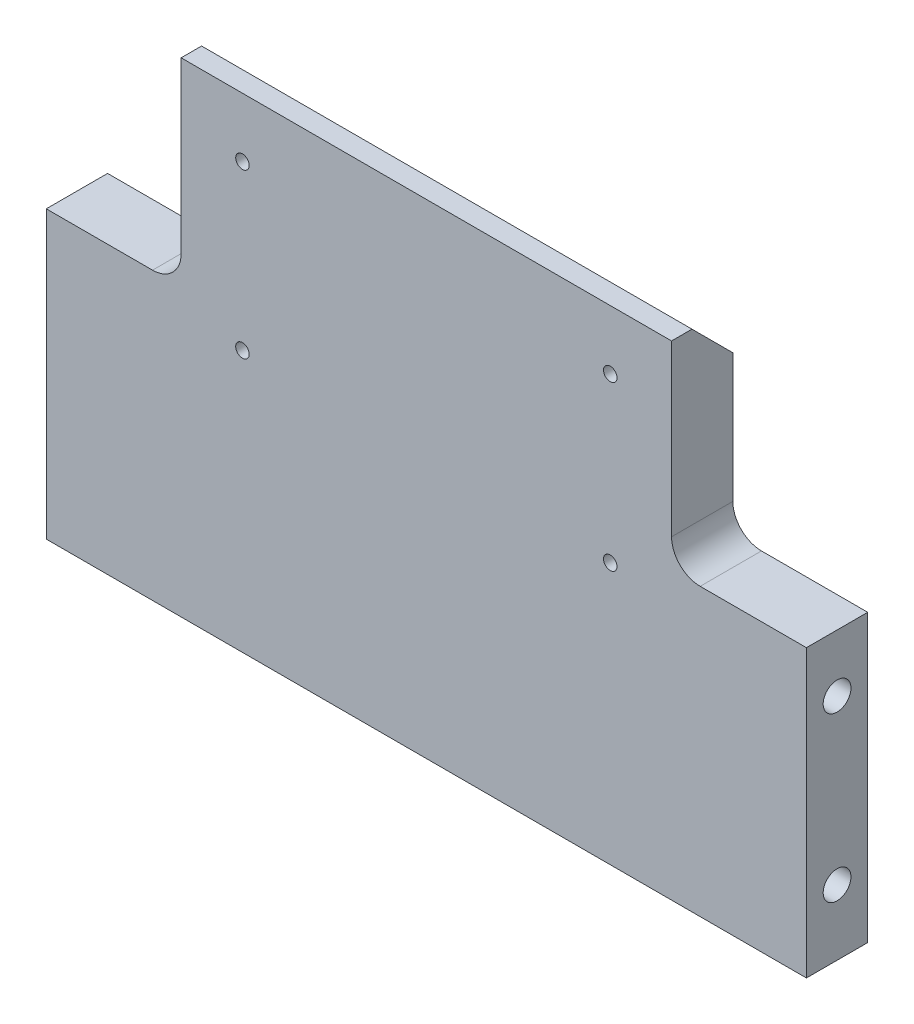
ISO-10303-21;
HEADER;
FILE_DESCRIPTION(('STEP AP214'),'2;1');
FILE_NAME('part.step','',(''),(''),'','','');
FILE_SCHEMA(('AUTOMOTIVE_DESIGN { 1 0 10303 214 1 1 1 1 }'));
ENDSEC;
DATA;
#1=APPLICATION_CONTEXT('core data for automotive mechanical design processes');
#2=APPLICATION_PROTOCOL_DEFINITION('international standard','automotive_design',2000,#1);
#3=PRODUCT_CONTEXT('',#1,'mechanical');
#4=PRODUCT('Part','Part','',(#3));
#5=PRODUCT_RELATED_PRODUCT_CATEGORY('part','',(#4));
#6=PRODUCT_DEFINITION_FORMATION('','',#4);
#7=PRODUCT_DEFINITION_CONTEXT('part definition',#1,'design');
#8=PRODUCT_DEFINITION('design','',#6,#7);
#9=PRODUCT_DEFINITION_SHAPE('','',#8);
#10=(LENGTH_UNIT() NAMED_UNIT(*) SI_UNIT(.MILLI.,.METRE.));
#11=(NAMED_UNIT(*) PLANE_ANGLE_UNIT() SI_UNIT($,.RADIAN.));
#12=(NAMED_UNIT(*) SI_UNIT($,.STERADIAN.) SOLID_ANGLE_UNIT());
#13=UNCERTAINTY_MEASURE_WITH_UNIT(LENGTH_MEASURE(1.E-05),#10,'distance_accuracy_value','');
#14=(GEOMETRIC_REPRESENTATION_CONTEXT(3) GLOBAL_UNCERTAINTY_ASSIGNED_CONTEXT((#13)) GLOBAL_UNIT_ASSIGNED_CONTEXT((#10,
#11,#12)) REPRESENTATION_CONTEXT('',''));
#15=CARTESIAN_POINT('',(0.,0.,0.));
#16=DIRECTION('',(0.,0.,1.));
#17=DIRECTION('',(1.,0.,0.));
#18=AXIS2_PLACEMENT_3D('',#15,#16,#17);
#19=CARTESIAN_POINT('',(-84.3265927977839,52.551108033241,15.));
#20=DIRECTION('',(1.,0.,0.));
#21=DIRECTION('',(0.,1.,0.));
#22=AXIS2_PLACEMENT_3D('',#19,#20,#21);
#23=PLANE('',#22);
#24=CARTESIAN_POINT('',(-84.3265927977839,-61.448891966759,7.5));
#25=DIRECTION('',(-1.,0.,0.));
#26=DIRECTION('',(0.,0.,1.));
#27=AXIS2_PLACEMENT_3D('',#24,#25,#26);
#28=CIRCLE('',#27,3.39999999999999);
#29=CARTESIAN_POINT('',(-84.3265927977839,-61.448891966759,10.9));
#30=VERTEX_POINT('',#29);
#31=EDGE_CURVE('E260',#30,#30,#28,.T.);
#32=ORIENTED_EDGE('',*,*,#31,.F.);
#33=EDGE_LOOP('',(#32));
#34=FACE_BOUND('',#33,.T.);
#35=CARTESIAN_POINT('',(-84.3265927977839,-21.4488919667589,7.5));
#36=DIRECTION('',(-1.,0.,0.));
#37=DIRECTION('',(0.,0.,1.));
#38=AXIS2_PLACEMENT_3D('',#35,#36,#37);
#39=CIRCLE('',#38,3.39999999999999);
#40=CARTESIAN_POINT('',(-84.3265927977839,-21.4488919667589,10.9));
#41=VERTEX_POINT('',#40);
#42=EDGE_CURVE('E264',#41,#41,#39,.T.);
#43=ORIENTED_EDGE('',*,*,#42,.F.);
#44=EDGE_LOOP('',(#43));
#45=FACE_BOUND('',#44,.T.);
#46=DIRECTION('',(0.,-1.,0.));
#47=VECTOR('',#46,1.);
#48=CARTESIAN_POINT('',(-84.3265927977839,52.551108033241,15.));
#49=LINE('',#48,#47);
#50=CARTESIAN_POINT('',(-84.3265927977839,-7.44889196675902,15.));
#51=VERTEX_POINT('',#50);
#52=CARTESIAN_POINT('',(-84.3265927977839,-77.448891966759,15.));
#53=VERTEX_POINT('',#52);
#54=EDGE_CURVE('E167',#51,#53,#49,.T.);
#55=ORIENTED_EDGE('',*,*,#54,.F.);
#56=DIRECTION('',(0.,0.,1.));
#57=VECTOR('',#56,1.);
#58=CARTESIAN_POINT('',(-84.3265927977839,-7.44889196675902,0.));
#59=LINE('',#58,#57);
#60=CARTESIAN_POINT('',(-84.3265927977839,-7.44889196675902,0.));
#61=VERTEX_POINT('',#60);
#62=EDGE_CURVE('E158',#61,#51,#59,.T.);
#63=ORIENTED_EDGE('',*,*,#62,.F.);
#64=DIRECTION('',(0.,-1.,0.));
#65=VECTOR('',#64,1.);
#66=CARTESIAN_POINT('',(-84.3265927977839,52.551108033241,0.));
#67=LINE('',#66,#65);
#68=CARTESIAN_POINT('',(-84.3265927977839,-77.448891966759,0.));
#69=VERTEX_POINT('',#68);
#70=EDGE_CURVE('E160',#61,#69,#67,.T.);
#71=ORIENTED_EDGE('',*,*,#70,.T.);
#72=DIRECTION('',(0.,0.,-1.));
#73=VECTOR('',#72,1.);
#74=CARTESIAN_POINT('',(-84.3265927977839,-77.448891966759,15.));
#75=LINE('',#74,#73);
#76=EDGE_CURVE('E177',#53,#69,#75,.T.);
#77=ORIENTED_EDGE('',*,*,#76,.F.);
#78=EDGE_LOOP('',(#55,#63,#71,#77));
#79=FACE_BOUND('',#78,.T.);
#80=ADVANCED_FACE('F32',(#34,#45,#79),#23,.F.);
#81=CARTESIAN_POINT('',(-84.3265927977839,-77.448891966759,15.));
#82=DIRECTION('',(0.,1.,0.));
#83=DIRECTION('',(0.,0.,1.));
#84=AXIS2_PLACEMENT_3D('',#81,#82,#83);
#85=PLANE('',#84);
#86=DIRECTION('',(1.,0.,0.));
#87=VECTOR('',#86,1.);
#88=CARTESIAN_POINT('',(-84.3265927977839,-77.448891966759,0.));
#89=LINE('',#88,#87);
#90=CARTESIAN_POINT('',(101.673407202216,-77.448891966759,0.));
#91=VERTEX_POINT('',#90);
#92=EDGE_CURVE('E162',#69,#91,#89,.T.);
#93=ORIENTED_EDGE('',*,*,#92,.T.);
#94=DIRECTION('',(0.,0.,-1.));
#95=VECTOR('',#94,1.);
#96=CARTESIAN_POINT('',(101.673407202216,-77.448891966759,15.));
#97=LINE('',#96,#95);
#98=CARTESIAN_POINT('',(101.673407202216,-77.448891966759,15.));
#99=VERTEX_POINT('',#98);
#100=EDGE_CURVE('E174',#99,#91,#97,.T.);
#101=ORIENTED_EDGE('',*,*,#100,.F.);
#102=DIRECTION('',(1.,0.,0.));
#103=VECTOR('',#102,1.);
#104=CARTESIAN_POINT('',(-84.3265927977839,-77.448891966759,15.));
#105=LINE('',#104,#103);
#106=EDGE_CURVE('E169',#53,#99,#105,.T.);
#107=ORIENTED_EDGE('',*,*,#106,.F.);
#108=ORIENTED_EDGE('',*,*,#76,.T.);
#109=EDGE_LOOP('',(#93,#101,#107,#108));
#110=FACE_BOUND('',#109,.T.);
#111=ADVANCED_FACE('F231',(#110),#85,.F.);
#112=CARTESIAN_POINT('',(101.673407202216,52.551108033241,15.));
#113=DIRECTION('',(-1.,0.,0.));
#114=DIRECTION('',(0.,0.,1.));
#115=AXIS2_PLACEMENT_3D('',#112,#113,#114);
#116=PLANE('',#115);
#117=CARTESIAN_POINT('',(101.673407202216,-61.448891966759,7.5));
#118=DIRECTION('',(1.,0.,0.));
#119=DIRECTION('',(0.,0.,-1.));
#120=AXIS2_PLACEMENT_3D('',#117,#118,#119);
#121=CIRCLE('',#120,3.39999999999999);
#122=CARTESIAN_POINT('',(101.673407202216,-61.448891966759,4.10000000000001));
#123=VERTEX_POINT('',#122);
#124=EDGE_CURVE('E291',#123,#123,#121,.T.);
#125=ORIENTED_EDGE('',*,*,#124,.F.);
#126=EDGE_LOOP('',(#125));
#127=FACE_BOUND('',#126,.T.);
#128=CARTESIAN_POINT('',(101.673407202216,-21.448891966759,7.5));
#129=DIRECTION('',(1.,0.,0.));
#130=DIRECTION('',(0.,0.,-1.));
#131=AXIS2_PLACEMENT_3D('',#128,#129,#130);
#132=CIRCLE('',#131,3.39999999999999);
#133=CARTESIAN_POINT('',(101.673407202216,-21.448891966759,4.10000000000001));
#134=VERTEX_POINT('',#133);
#135=EDGE_CURVE('E294',#134,#134,#132,.T.);
#136=ORIENTED_EDGE('',*,*,#135,.F.);
#137=EDGE_LOOP('',(#136));
#138=FACE_BOUND('',#137,.T.);
#139=DIRECTION('',(0.,1.,0.));
#140=VECTOR('',#139,1.);
#141=CARTESIAN_POINT('',(101.673407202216,52.551108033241,0.));
#142=LINE('',#141,#140);
#143=CARTESIAN_POINT('',(101.673407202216,-7.44889196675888,0.));
#144=VERTEX_POINT('',#143);
#145=EDGE_CURVE('E164',#91,#144,#142,.T.);
#146=ORIENTED_EDGE('',*,*,#145,.T.);
#147=DIRECTION('',(0.,0.,1.));
#148=VECTOR('',#147,1.);
#149=CARTESIAN_POINT('',(101.673407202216,-7.44889196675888,0.));
#150=LINE('',#149,#148);
#151=CARTESIAN_POINT('',(101.673407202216,-7.44889196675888,15.));
#152=VERTEX_POINT('',#151);
#153=EDGE_CURVE('E152',#144,#152,#150,.T.);
#154=ORIENTED_EDGE('',*,*,#153,.T.);
#155=DIRECTION('',(0.,1.,0.));
#156=VECTOR('',#155,1.);
#157=CARTESIAN_POINT('',(101.673407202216,52.551108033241,15.));
#158=LINE('',#157,#156);
#159=EDGE_CURVE('E171',#99,#152,#158,.T.);
#160=ORIENTED_EDGE('',*,*,#159,.F.);
#161=ORIENTED_EDGE('',*,*,#100,.T.);
#162=EDGE_LOOP('',(#146,#154,#160,#161));
#163=FACE_BOUND('',#162,.T.);
#164=ADVANCED_FACE('F220',(#127,#138,#163),#116,.F.);
#165=CARTESIAN_POINT('',(-84.3265927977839,52.551108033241,15.));
#166=DIRECTION('',(0.,0.,1.));
#167=DIRECTION('',(1.,0.,0.));
#168=AXIS2_PLACEMENT_3D('',#165,#166,#167);
#169=PLANE('',#168);
#170=DIRECTION('',(1.,0.,0.));
#171=VECTOR('',#170,1.);
#172=CARTESIAN_POINT('',(-51.326592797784,41.051108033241,15.));
#173=LINE('',#172,#171);
#174=CARTESIAN_POINT('',(-51.326592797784,41.051108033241,15.));
#175=VERTEX_POINT('',#174);
#176=CARTESIAN_POINT('',(68.673407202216,41.051108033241,15.));
#177=VERTEX_POINT('',#176);
#178=EDGE_CURVE('E125',#175,#177,#173,.T.);
#179=ORIENTED_EDGE('',*,*,#178,.F.);
#180=DIRECTION('',(0.,1.,0.));
#181=VECTOR('',#180,1.);
#182=CARTESIAN_POINT('',(-51.326592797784,52.551108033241,15.));
#183=LINE('',#182,#181);
#184=CARTESIAN_POINT('',(-51.326592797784,-0.448891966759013,15.));
#185=VERTEX_POINT('',#184);
#186=EDGE_CURVE('E136',#185,#175,#183,.T.);
#187=ORIENTED_EDGE('',*,*,#186,.F.);
#188=CARTESIAN_POINT('',(-58.326592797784,-0.448891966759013,15.));
#189=DIRECTION('',(0.,0.,1.));
#190=DIRECTION('',(1.,0.,0.));
#191=AXIS2_PLACEMENT_3D('',#188,#189,#190);
#192=CIRCLE('',#191,7.);
#193=CARTESIAN_POINT('',(-58.326592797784,-7.44889196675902,15.));
#194=VERTEX_POINT('',#193);
#195=EDGE_CURVE('E193',#185,#194,#192,.F.);
#196=ORIENTED_EDGE('',*,*,#195,.T.);
#197=DIRECTION('',(1.,0.,0.));
#198=VECTOR('',#197,1.);
#199=CARTESIAN_POINT('',(-84.3265927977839,-7.44889196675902,15.));
#200=LINE('',#199,#198);
#201=EDGE_CURVE('E146',#51,#194,#200,.T.);
#202=ORIENTED_EDGE('',*,*,#201,.F.);
#203=ORIENTED_EDGE('',*,*,#54,.T.);
#204=ORIENTED_EDGE('',*,*,#106,.T.);
#205=ORIENTED_EDGE('',*,*,#159,.T.);
#206=DIRECTION('',(1.,0.,0.));
#207=VECTOR('',#206,1.);
#208=CARTESIAN_POINT('',(68.6734072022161,-7.44889196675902,15.));
#209=LINE('',#208,#207);
#210=CARTESIAN_POINT('',(75.6734072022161,-7.44889196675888,15.));
#211=VERTEX_POINT('',#210);
#212=EDGE_CURVE('E211',#211,#152,#209,.T.);
#213=ORIENTED_EDGE('',*,*,#212,.F.);
#214=CARTESIAN_POINT('',(75.6734072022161,-0.448891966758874,15.));
#215=DIRECTION('',(0.,0.,1.));
#216=DIRECTION('',(1.,0.,0.));
#217=AXIS2_PLACEMENT_3D('',#214,#215,#216);
#218=CIRCLE('',#217,7.);
#219=CARTESIAN_POINT('',(68.6734072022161,-0.448891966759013,15.));
#220=VERTEX_POINT('',#219);
#221=EDGE_CURVE('E189',#211,#220,#218,.F.);
#222=ORIENTED_EDGE('',*,*,#221,.T.);
#223=DIRECTION('',(0.,-1.,0.));
#224=VECTOR('',#223,1.);
#225=CARTESIAN_POINT('',(68.673407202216,52.551108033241,15.));
#226=LINE('',#225,#224);
#227=EDGE_CURVE('E138',#177,#220,#226,.T.);
#228=ORIENTED_EDGE('',*,*,#227,.F.);
#229=EDGE_LOOP('',(#179,#187,#196,#202,#203,#204,#205,#213,#222,#228));
#230=FACE_BOUND('',#229,.T.);
#231=CARTESIAN_POINT('',(-36.326592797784,26.551108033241,15.));
#232=DIRECTION('',(0.,0.,1.));
#233=DIRECTION('',(1.,0.,0.));
#234=AXIS2_PLACEMENT_3D('',#231,#232,#233);
#235=CIRCLE('',#234,1.64999999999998);
#236=CARTESIAN_POINT('',(-34.676592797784,26.551108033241,15.));
#237=VERTEX_POINT('',#236);
#238=EDGE_CURVE('E427',#237,#237,#235,.T.);
#239=ORIENTED_EDGE('',*,*,#238,.F.);
#240=EDGE_LOOP('',(#239));
#241=FACE_BOUND('',#240,.T.);
#242=CARTESIAN_POINT('',(53.673407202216,26.551108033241,15.));
#243=DIRECTION('',(0.,0.,1.));
#244=DIRECTION('',(1.,0.,0.));
#245=AXIS2_PLACEMENT_3D('',#242,#243,#244);
#246=CIRCLE('',#245,1.64999999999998);
#247=CARTESIAN_POINT('',(55.323407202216,26.551108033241,15.));
#248=VERTEX_POINT('',#247);
#249=EDGE_CURVE('E421',#248,#248,#246,.T.);
#250=ORIENTED_EDGE('',*,*,#249,.F.);
#251=EDGE_LOOP('',(#250));
#252=FACE_BOUND('',#251,.T.);
#253=CARTESIAN_POINT('',(53.673407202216,-13.448891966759,15.));
#254=DIRECTION('',(0.,0.,1.));
#255=DIRECTION('',(1.,0.,0.));
#256=AXIS2_PLACEMENT_3D('',#253,#254,#255);
#257=CIRCLE('',#256,1.64999999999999);
#258=CARTESIAN_POINT('',(55.323407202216,-13.448891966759,15.));
#259=VERTEX_POINT('',#258);
#260=EDGE_CURVE('E345',#259,#259,#257,.T.);
#261=ORIENTED_EDGE('',*,*,#260,.F.);
#262=EDGE_LOOP('',(#261));
#263=FACE_BOUND('',#262,.T.);
#264=CARTESIAN_POINT('',(-36.326592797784,-13.448891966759,15.));
#265=DIRECTION('',(0.,0.,1.));
#266=DIRECTION('',(1.,0.,0.));
#267=AXIS2_PLACEMENT_3D('',#264,#265,#266);
#268=CIRCLE('',#267,1.64999999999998);
#269=CARTESIAN_POINT('',(-34.676592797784,-13.448891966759,15.));
#270=VERTEX_POINT('',#269);
#271=EDGE_CURVE('E339',#270,#270,#268,.T.);
#272=ORIENTED_EDGE('',*,*,#271,.F.);
#273=EDGE_LOOP('',(#272));
#274=FACE_BOUND('',#273,.T.);
#275=ADVANCED_FACE('F134',(#230,#241,#252,#263,#274),#169,.T.);
#276=CARTESIAN_POINT('',(-84.3265927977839,52.551108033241,0.));
#277=DIRECTION('',(0.,0.,1.));
#278=DIRECTION('',(1.,0.,0.));
#279=AXIS2_PLACEMENT_3D('',#276,#277,#278);
#280=PLANE('',#279);
#281=CARTESIAN_POINT('',(-36.326592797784,26.551108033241,0.));
#282=DIRECTION('',(0.,0.,1.));
#283=DIRECTION('',(1.,0.,0.));
#284=AXIS2_PLACEMENT_3D('',#281,#282,#283);
#285=CIRCLE('',#284,1.64999999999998);
#286=CARTESIAN_POINT('',(-34.676592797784,26.551108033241,0.));
#287=VERTEX_POINT('',#286);
#288=EDGE_CURVE('E130',#287,#287,#285,.T.);
#289=ORIENTED_EDGE('',*,*,#288,.T.);
#290=EDGE_LOOP('',(#289));
#291=FACE_BOUND('',#290,.T.);
#292=CARTESIAN_POINT('',(53.673407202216,26.551108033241,0.));
#293=DIRECTION('',(0.,0.,1.));
#294=DIRECTION('',(1.,0.,0.));
#295=AXIS2_PLACEMENT_3D('',#292,#293,#294);
#296=CIRCLE('',#295,1.64999999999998);
#297=CARTESIAN_POINT('',(55.323407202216,26.551108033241,0.));
#298=VERTEX_POINT('',#297);
#299=EDGE_CURVE('E424',#298,#298,#296,.T.);
#300=ORIENTED_EDGE('',*,*,#299,.T.);
#301=EDGE_LOOP('',(#300));
#302=FACE_BOUND('',#301,.T.);
#303=CARTESIAN_POINT('',(53.673407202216,-13.448891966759,0.));
#304=DIRECTION('',(0.,0.,1.));
#305=DIRECTION('',(1.,0.,0.));
#306=AXIS2_PLACEMENT_3D('',#303,#304,#305);
#307=CIRCLE('',#306,1.64999999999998);
#308=CARTESIAN_POINT('',(55.323407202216,-13.448891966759,0.));
#309=VERTEX_POINT('',#308);
#310=EDGE_CURVE('E418',#309,#309,#307,.T.);
#311=ORIENTED_EDGE('',*,*,#310,.T.);
#312=EDGE_LOOP('',(#311));
#313=FACE_BOUND('',#312,.T.);
#314=CARTESIAN_POINT('',(-36.326592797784,-13.448891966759,0.));
#315=DIRECTION('',(0.,0.,1.));
#316=DIRECTION('',(1.,0.,0.));
#317=AXIS2_PLACEMENT_3D('',#314,#315,#316);
#318=CIRCLE('',#317,1.64999999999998);
#319=CARTESIAN_POINT('',(-34.676592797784,-13.448891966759,0.));
#320=VERTEX_POINT('',#319);
#321=EDGE_CURVE('E336',#320,#320,#318,.T.);
#322=ORIENTED_EDGE('',*,*,#321,.T.);
#323=EDGE_LOOP('',(#322));
#324=FACE_BOUND('',#323,.T.);
#325=DIRECTION('',(0.,1.,0.));
#326=VECTOR('',#325,1.);
#327=CARTESIAN_POINT('',(-51.326592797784,52.551108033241,0.));
#328=LINE('',#327,#326);
#329=CARTESIAN_POINT('',(-51.326592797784,-0.448891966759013,0.));
#330=VERTEX_POINT('',#329);
#331=CARTESIAN_POINT('',(-51.326592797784,31.051108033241,0.));
#332=VERTEX_POINT('',#331);
#333=EDGE_CURVE('E149',#330,#332,#328,.T.);
#334=ORIENTED_EDGE('',*,*,#333,.T.);
#335=DIRECTION('',(1.,0.,0.));
#336=VECTOR('',#335,1.);
#337=CARTESIAN_POINT('',(-84.3265927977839,31.051108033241,0.));
#338=LINE('',#337,#336);
#339=CARTESIAN_POINT('',(68.6734072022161,31.051108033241,0.));
#340=VERTEX_POINT('',#339);
#341=EDGE_CURVE('E199',#332,#340,#338,.T.);
#342=ORIENTED_EDGE('',*,*,#341,.T.);
#343=DIRECTION('',(0.,-1.,0.));
#344=VECTOR('',#343,1.);
#345=CARTESIAN_POINT('',(68.673407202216,52.551108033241,0.));
#346=LINE('',#345,#344);
#347=CARTESIAN_POINT('',(68.6734072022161,-0.448891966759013,0.));
#348=VERTEX_POINT('',#347);
#349=EDGE_CURVE('E205',#340,#348,#346,.T.);
#350=ORIENTED_EDGE('',*,*,#349,.T.);
#351=CARTESIAN_POINT('',(75.6734072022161,-0.448891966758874,0.));
#352=DIRECTION('',(0.,0.,1.));
#353=DIRECTION('',(1.,0.,0.));
#354=AXIS2_PLACEMENT_3D('',#351,#352,#353);
#355=CIRCLE('',#354,7.);
#356=CARTESIAN_POINT('',(75.6734072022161,-7.44889196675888,0.));
#357=VERTEX_POINT('',#356);
#358=EDGE_CURVE('E191',#348,#357,#355,.T.);
#359=ORIENTED_EDGE('',*,*,#358,.T.);
#360=DIRECTION('',(1.,0.,0.));
#361=VECTOR('',#360,1.);
#362=CARTESIAN_POINT('',(68.6734072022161,-7.44889196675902,0.));
#363=LINE('',#362,#361);
#364=EDGE_CURVE('E210',#357,#144,#363,.T.);
#365=ORIENTED_EDGE('',*,*,#364,.T.);
#366=ORIENTED_EDGE('',*,*,#145,.F.);
#367=ORIENTED_EDGE('',*,*,#92,.F.);
#368=ORIENTED_EDGE('',*,*,#70,.F.);
#369=DIRECTION('',(1.,0.,0.));
#370=VECTOR('',#369,1.);
#371=CARTESIAN_POINT('',(-84.3265927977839,-7.44889196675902,0.));
#372=LINE('',#371,#370);
#373=CARTESIAN_POINT('',(-58.326592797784,-7.44889196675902,0.));
#374=VERTEX_POINT('',#373);
#375=EDGE_CURVE('E145',#61,#374,#372,.T.);
#376=ORIENTED_EDGE('',*,*,#375,.T.);
#377=CARTESIAN_POINT('',(-58.326592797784,-0.448891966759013,0.));
#378=DIRECTION('',(0.,0.,1.));
#379=DIRECTION('',(1.,0.,0.));
#380=AXIS2_PLACEMENT_3D('',#377,#378,#379);
#381=CIRCLE('',#380,7.);
#382=EDGE_CURVE('E195',#374,#330,#381,.T.);
#383=ORIENTED_EDGE('',*,*,#382,.T.);
#384=EDGE_LOOP('',(#334,#342,#350,#359,#365,#366,#367,#368,#376,#383));
#385=FACE_BOUND('',#384,.T.);
#386=ADVANCED_FACE('F204',(#291,#302,#313,#324,#385),#280,.F.);
#387=CARTESIAN_POINT('',(-51.326592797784,52.551108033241,0.));
#388=DIRECTION('',(1.,0.,0.));
#389=DIRECTION('',(0.,1.,0.));
#390=AXIS2_PLACEMENT_3D('',#387,#388,#389);
#391=PLANE('',#390);
#392=DIRECTION('',(0.,0.,1.));
#393=VECTOR('',#392,1.);
#394=CARTESIAN_POINT('',(-51.326592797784,41.051108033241,-25.));
#395=LINE('',#394,#393);
#396=CARTESIAN_POINT('',(-51.326592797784,41.051108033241,10.));
#397=VERTEX_POINT('',#396);
#398=EDGE_CURVE('E122',#397,#175,#395,.T.);
#399=ORIENTED_EDGE('',*,*,#398,.F.);
#400=DIRECTION('',(0.,0.707106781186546,0.707106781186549));
#401=VECTOR('',#400,1.);
#402=CARTESIAN_POINT('',(-51.326592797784,31.051108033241,0.));
#403=LINE('',#402,#401);
#404=EDGE_CURVE('E11',#397,#332,#403,.F.);
#405=ORIENTED_EDGE('',*,*,#404,.T.);
#406=ORIENTED_EDGE('',*,*,#333,.F.);
#407=DIRECTION('',(0.,0.,1.));
#408=VECTOR('',#407,1.);
#409=CARTESIAN_POINT('',(-51.326592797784,-0.448891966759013,15.));
#410=LINE('',#409,#408);
#411=EDGE_CURVE('E144',#330,#185,#410,.T.);
#412=ORIENTED_EDGE('',*,*,#411,.T.);
#413=ORIENTED_EDGE('',*,*,#186,.T.);
#414=EDGE_LOOP('',(#399,#405,#406,#412,#413));
#415=FACE_BOUND('',#414,.T.);
#416=ADVANCED_FACE('F141',(#415),#391,.F.);
#417=CARTESIAN_POINT('',(-84.3265927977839,-7.44889196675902,0.));
#418=DIRECTION('',(0.,-1.,0.));
#419=DIRECTION('',(0.,0.,-1.));
#420=AXIS2_PLACEMENT_3D('',#417,#418,#419);
#421=PLANE('',#420);
#422=ORIENTED_EDGE('',*,*,#201,.T.);
#423=DIRECTION('',(0.,0.,1.));
#424=VECTOR('',#423,1.);
#425=CARTESIAN_POINT('',(-58.326592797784,-7.44889196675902,0.));
#426=LINE('',#425,#424);
#427=EDGE_CURVE('E187',#194,#374,#426,.F.);
#428=ORIENTED_EDGE('',*,*,#427,.T.);
#429=ORIENTED_EDGE('',*,*,#375,.F.);
#430=ORIENTED_EDGE('',*,*,#62,.T.);
#431=EDGE_LOOP('',(#422,#428,#429,#430));
#432=FACE_BOUND('',#431,.T.);
#433=ADVANCED_FACE('F269',(#432),#421,.F.);
#434=CARTESIAN_POINT('',(68.673407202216,52.551108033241,0.));
#435=DIRECTION('',(-1.,0.,0.));
#436=DIRECTION('',(0.,-1.,0.));
#437=AXIS2_PLACEMENT_3D('',#434,#435,#436);
#438=PLANE('',#437);
#439=ORIENTED_EDGE('',*,*,#349,.F.);
#440=DIRECTION('',(0.,-0.707106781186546,-0.707106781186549));
#441=VECTOR('',#440,1.);
#442=CARTESIAN_POINT('',(68.6734072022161,31.051108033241,0.));
#443=LINE('',#442,#441);
#444=CARTESIAN_POINT('',(68.673407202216,41.051108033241,10.));
#445=VERTEX_POINT('',#444);
#446=EDGE_CURVE('E53',#340,#445,#443,.F.);
#447=ORIENTED_EDGE('',*,*,#446,.T.);
#448=DIRECTION('',(0.,0.,1.));
#449=VECTOR('',#448,1.);
#450=CARTESIAN_POINT('',(68.673407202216,41.051108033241,0.));
#451=LINE('',#450,#449);
#452=EDGE_CURVE('E197',#445,#177,#451,.T.);
#453=ORIENTED_EDGE('',*,*,#452,.T.);
#454=ORIENTED_EDGE('',*,*,#227,.T.);
#455=DIRECTION('',(0.,0.,1.));
#456=VECTOR('',#455,1.);
#457=CARTESIAN_POINT('',(68.6734072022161,-0.448891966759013,0.));
#458=LINE('',#457,#456);
#459=EDGE_CURVE('E183',#220,#348,#458,.F.);
#460=ORIENTED_EDGE('',*,*,#459,.T.);
#461=EDGE_LOOP('',(#439,#447,#453,#454,#460));
#462=FACE_BOUND('',#461,.T.);
#463=ADVANCED_FACE('F207',(#462),#438,.F.);
#464=CARTESIAN_POINT('',(68.6734072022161,-7.44889196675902,0.));
#465=DIRECTION('',(0.,-1.,0.));
#466=DIRECTION('',(0.,0.,-1.));
#467=AXIS2_PLACEMENT_3D('',#464,#465,#466);
#468=PLANE('',#467);
#469=ORIENTED_EDGE('',*,*,#364,.F.);
#470=DIRECTION('',(0.,0.,1.));
#471=VECTOR('',#470,1.);
#472=CARTESIAN_POINT('',(75.6734072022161,-7.44889196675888,15.));
#473=LINE('',#472,#471);
#474=EDGE_CURVE('E180',#357,#211,#473,.T.);
#475=ORIENTED_EDGE('',*,*,#474,.T.);
#476=ORIENTED_EDGE('',*,*,#212,.T.);
#477=ORIENTED_EDGE('',*,*,#153,.F.);
#478=EDGE_LOOP('',(#469,#475,#476,#477));
#479=FACE_BOUND('',#478,.T.);
#480=ADVANCED_FACE('F235',(#479),#468,.F.);
#481=CARTESIAN_POINT('',(-84.3265927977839,-21.4488919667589,7.5));
#482=DIRECTION('',(-1.,0.,0.));
#483=DIRECTION('',(0.,0.,1.));
#484=AXIS2_PLACEMENT_3D('',#481,#482,#483);
#485=CYLINDRICAL_SURFACE('',#484,3.39999999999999);
#486=CARTESIAN_POINT('',(-38.0765927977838,-21.448891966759,7.5));
#487=DIRECTION('',(-1.,0.,0.));
#488=DIRECTION('',(0.,0.,1.));
#489=AXIS2_PLACEMENT_3D('',#486,#487,#488);
#490=CIRCLE('',#489,3.39999999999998);
#491=CARTESIAN_POINT('',(-38.0765927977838,-21.448891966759,10.9));
#492=VERTEX_POINT('',#491);
#493=EDGE_CURVE('E306',#492,#492,#490,.T.);
#494=ORIENTED_EDGE('',*,*,#493,.F.);
#495=EDGE_LOOP('',(#494));
#496=FACE_BOUND('',#495,.T.);
#497=ORIENTED_EDGE('',*,*,#42,.T.);
#498=EDGE_LOOP('',(#497));
#499=FACE_BOUND('',#498,.T.);
#500=ADVANCED_FACE('F375',(#496,#499),#485,.F.);
#501=CARTESIAN_POINT('',(-38.0765927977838,-21.448891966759,7.5));
#502=DIRECTION('',(-1.,0.,0.));
#503=DIRECTION('',(0.,0.,1.));
#504=AXIS2_PLACEMENT_3D('',#501,#502,#503);
#505=CONICAL_SURFACE('',#504,3.39999999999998,1.02974425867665);
#506=CARTESIAN_POINT('',(-36.0336666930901,-21.448891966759,7.5));
#507=VERTEX_POINT('',#506);
#508=VERTEX_LOOP('',#507);
#509=FACE_BOUND('',#508,.T.);
#510=ORIENTED_EDGE('',*,*,#493,.T.);
#511=EDGE_LOOP('',(#510));
#512=FACE_BOUND('',#511,.T.);
#513=ADVANCED_FACE('F371',(#509,#512),#505,.F.);
#514=CARTESIAN_POINT('',(-84.3265927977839,-61.448891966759,7.5));
#515=DIRECTION('',(-1.,0.,0.));
#516=DIRECTION('',(0.,0.,1.));
#517=AXIS2_PLACEMENT_3D('',#514,#515,#516);
#518=CYLINDRICAL_SURFACE('',#517,3.39999999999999);
#519=CARTESIAN_POINT('',(-38.0765927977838,-61.448891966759,7.5));
#520=DIRECTION('',(-1.,0.,0.));
#521=DIRECTION('',(0.,0.,1.));
#522=AXIS2_PLACEMENT_3D('',#519,#520,#521);
#523=CIRCLE('',#522,3.39999999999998);
#524=CARTESIAN_POINT('',(-38.0765927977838,-61.448891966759,10.9));
#525=VERTEX_POINT('',#524);
#526=EDGE_CURVE('E296',#525,#525,#523,.T.);
#527=ORIENTED_EDGE('',*,*,#526,.F.);
#528=EDGE_LOOP('',(#527));
#529=FACE_BOUND('',#528,.T.);
#530=ORIENTED_EDGE('',*,*,#31,.T.);
#531=EDGE_LOOP('',(#530));
#532=FACE_BOUND('',#531,.T.);
#533=ADVANCED_FACE('F367',(#529,#532),#518,.F.);
#534=CARTESIAN_POINT('',(-38.0765927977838,-61.448891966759,7.5));
#535=DIRECTION('',(-1.,0.,0.));
#536=DIRECTION('',(0.,0.,1.));
#537=AXIS2_PLACEMENT_3D('',#534,#535,#536);
#538=CONICAL_SURFACE('',#537,3.39999999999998,1.02974425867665);
#539=CARTESIAN_POINT('',(-36.0336666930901,-61.448891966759,7.5));
#540=VERTEX_POINT('',#539);
#541=VERTEX_LOOP('',#540);
#542=FACE_BOUND('',#541,.T.);
#543=ORIENTED_EDGE('',*,*,#526,.T.);
#544=EDGE_LOOP('',(#543));
#545=FACE_BOUND('',#544,.T.);
#546=ADVANCED_FACE('F363',(#542,#545),#538,.F.);
#547=CARTESIAN_POINT('',(101.673407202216,-21.448891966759,7.5));
#548=DIRECTION('',(1.,0.,0.));
#549=DIRECTION('',(0.,0.,-1.));
#550=AXIS2_PLACEMENT_3D('',#547,#548,#549);
#551=CYLINDRICAL_SURFACE('',#550,3.39999999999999);
#552=CARTESIAN_POINT('',(55.4234072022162,-21.448891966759,7.5));
#553=DIRECTION('',(1.,0.,0.));
#554=DIRECTION('',(0.,0.,-1.));
#555=AXIS2_PLACEMENT_3D('',#552,#553,#554);
#556=CIRCLE('',#555,3.39999999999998);
#557=CARTESIAN_POINT('',(55.4234072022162,-21.448891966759,4.10000000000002));
#558=VERTEX_POINT('',#557);
#559=EDGE_CURVE('E297',#558,#558,#556,.T.);
#560=ORIENTED_EDGE('',*,*,#559,.F.);
#561=EDGE_LOOP('',(#560));
#562=FACE_BOUND('',#561,.T.);
#563=ORIENTED_EDGE('',*,*,#135,.T.);
#564=EDGE_LOOP('',(#563));
#565=FACE_BOUND('',#564,.T.);
#566=ADVANCED_FACE('F357',(#562,#565),#551,.F.);
#567=CARTESIAN_POINT('',(55.4234072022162,-21.448891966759,7.5));
#568=DIRECTION('',(1.,0.,0.));
#569=DIRECTION('',(0.,0.,-1.));
#570=AXIS2_PLACEMENT_3D('',#567,#568,#569);
#571=CONICAL_SURFACE('',#570,3.39999999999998,1.02974425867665);
#572=CARTESIAN_POINT('',(53.3804810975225,-21.448891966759,7.5));
#573=VERTEX_POINT('',#572);
#574=VERTEX_LOOP('',#573);
#575=FACE_BOUND('',#574,.T.);
#576=ORIENTED_EDGE('',*,*,#559,.T.);
#577=EDGE_LOOP('',(#576));
#578=FACE_BOUND('',#577,.T.);
#579=ADVANCED_FACE('F350',(#575,#578),#571,.F.);
#580=CARTESIAN_POINT('',(101.673407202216,-61.448891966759,7.5));
#581=DIRECTION('',(1.,0.,0.));
#582=DIRECTION('',(0.,0.,-1.));
#583=AXIS2_PLACEMENT_3D('',#580,#581,#582);
#584=CYLINDRICAL_SURFACE('',#583,3.39999999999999);
#585=CARTESIAN_POINT('',(55.4234072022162,-61.448891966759,7.5));
#586=DIRECTION('',(1.,0.,0.));
#587=DIRECTION('',(0.,0.,-1.));
#588=AXIS2_PLACEMENT_3D('',#585,#586,#587);
#589=CIRCLE('',#588,3.39999999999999);
#590=CARTESIAN_POINT('',(55.4234072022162,-61.448891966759,4.10000000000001));
#591=VERTEX_POINT('',#590);
#592=EDGE_CURVE('E341',#591,#591,#589,.T.);
#593=ORIENTED_EDGE('',*,*,#592,.F.);
#594=EDGE_LOOP('',(#593));
#595=FACE_BOUND('',#594,.T.);
#596=ORIENTED_EDGE('',*,*,#124,.T.);
#597=EDGE_LOOP('',(#596));
#598=FACE_BOUND('',#597,.T.);
#599=ADVANCED_FACE('F249',(#595,#598),#584,.F.);
#600=CARTESIAN_POINT('',(55.4234072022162,-61.448891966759,7.5));
#601=DIRECTION('',(1.,0.,0.));
#602=DIRECTION('',(0.,0.,-1.));
#603=AXIS2_PLACEMENT_3D('',#600,#601,#602);
#604=CONICAL_SURFACE('',#603,3.39999999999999,1.02974425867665);
#605=CARTESIAN_POINT('',(53.3804810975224,-61.448891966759,7.5));
#606=VERTEX_POINT('',#605);
#607=VERTEX_LOOP('',#606);
#608=FACE_BOUND('',#607,.T.);
#609=ORIENTED_EDGE('',*,*,#592,.T.);
#610=EDGE_LOOP('',(#609));
#611=FACE_BOUND('',#610,.T.);
#612=ADVANCED_FACE('F240',(#608,#611),#604,.F.);
#613=CARTESIAN_POINT('',(75.6734072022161,-0.448891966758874,0.));
#614=DIRECTION('',(0.,0.,-1.));
#615=DIRECTION('',(-1.,0.,0.));
#616=AXIS2_PLACEMENT_3D('',#613,#614,#615);
#617=CYLINDRICAL_SURFACE('',#616,7.);
#618=ORIENTED_EDGE('',*,*,#358,.F.);
#619=ORIENTED_EDGE('',*,*,#459,.F.);
#620=ORIENTED_EDGE('',*,*,#221,.F.);
#621=ORIENTED_EDGE('',*,*,#474,.F.);
#622=EDGE_LOOP('',(#618,#619,#620,#621));
#623=FACE_BOUND('',#622,.T.);
#624=ADVANCED_FACE('F237',(#623),#617,.F.);
#625=CARTESIAN_POINT('',(-58.326592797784,-0.448891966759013,0.));
#626=DIRECTION('',(0.,0.,-1.));
#627=DIRECTION('',(-1.,0.,0.));
#628=AXIS2_PLACEMENT_3D('',#625,#626,#627);
#629=CYLINDRICAL_SURFACE('',#628,7.);
#630=ORIENTED_EDGE('',*,*,#382,.F.);
#631=ORIENTED_EDGE('',*,*,#427,.F.);
#632=ORIENTED_EDGE('',*,*,#195,.F.);
#633=ORIENTED_EDGE('',*,*,#411,.F.);
#634=EDGE_LOOP('',(#630,#631,#632,#633));
#635=FACE_BOUND('',#634,.T.);
#636=ADVANCED_FACE('F239',(#635),#629,.F.);
#637=CARTESIAN_POINT('',(-36.326592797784,-13.448891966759,15.));
#638=DIRECTION('',(0.,0.,1.));
#639=DIRECTION('',(1.,0.,0.));
#640=AXIS2_PLACEMENT_3D('',#637,#638,#639);
#641=CYLINDRICAL_SURFACE('',#640,1.64999999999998);
#642=ORIENTED_EDGE('',*,*,#321,.F.);
#643=EDGE_LOOP('',(#642));
#644=FACE_BOUND('',#643,.T.);
#645=ORIENTED_EDGE('',*,*,#271,.T.);
#646=EDGE_LOOP('',(#645));
#647=FACE_BOUND('',#646,.T.);
#648=ADVANCED_FACE('F246',(#644,#647),#641,.F.);
#649=CARTESIAN_POINT('',(53.673407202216,-13.448891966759,15.));
#650=DIRECTION('',(0.,0.,1.));
#651=DIRECTION('',(1.,0.,0.));
#652=AXIS2_PLACEMENT_3D('',#649,#650,#651);
#653=CYLINDRICAL_SURFACE('',#652,1.64999999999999);
#654=ORIENTED_EDGE('',*,*,#310,.F.);
#655=EDGE_LOOP('',(#654));
#656=FACE_BOUND('',#655,.T.);
#657=ORIENTED_EDGE('',*,*,#260,.T.);
#658=EDGE_LOOP('',(#657));
#659=FACE_BOUND('',#658,.T.);
#660=ADVANCED_FACE('F324',(#656,#659),#653,.F.);
#661=CARTESIAN_POINT('',(53.673407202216,26.551108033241,15.));
#662=DIRECTION('',(0.,0.,1.));
#663=DIRECTION('',(1.,0.,0.));
#664=AXIS2_PLACEMENT_3D('',#661,#662,#663);
#665=CYLINDRICAL_SURFACE('',#664,1.64999999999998);
#666=ORIENTED_EDGE('',*,*,#299,.F.);
#667=EDGE_LOOP('',(#666));
#668=FACE_BOUND('',#667,.T.);
#669=ORIENTED_EDGE('',*,*,#249,.T.);
#670=EDGE_LOOP('',(#669));
#671=FACE_BOUND('',#670,.T.);
#672=ADVANCED_FACE('F320',(#668,#671),#665,.F.);
#673=CARTESIAN_POINT('',(-36.326592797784,26.551108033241,15.));
#674=DIRECTION('',(0.,0.,1.));
#675=DIRECTION('',(1.,0.,0.));
#676=AXIS2_PLACEMENT_3D('',#673,#674,#675);
#677=CYLINDRICAL_SURFACE('',#676,1.64999999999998);
#678=ORIENTED_EDGE('',*,*,#288,.F.);
#679=EDGE_LOOP('',(#678));
#680=FACE_BOUND('',#679,.T.);
#681=ORIENTED_EDGE('',*,*,#238,.T.);
#682=EDGE_LOOP('',(#681));
#683=FACE_BOUND('',#682,.T.);
#684=ADVANCED_FACE('F315',(#680,#683),#677,.F.);
#685=CARTESIAN_POINT('',(-51.326592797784,41.051108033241,-25.));
#686=DIRECTION('',(0.,-1.,0.));
#687=DIRECTION('',(0.,0.,-1.));
#688=AXIS2_PLACEMENT_3D('',#685,#686,#687);
#689=PLANE('',#688);
#690=ORIENTED_EDGE('',*,*,#452,.F.);
#691=DIRECTION('',(-1.,0.,0.));
#692=VECTOR('',#691,1.);
#693=CARTESIAN_POINT('',(-51.326592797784,41.051108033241,10.));
#694=LINE('',#693,#692);
#695=EDGE_CURVE('E39',#445,#397,#694,.T.);
#696=ORIENTED_EDGE('',*,*,#695,.T.);
#697=ORIENTED_EDGE('',*,*,#398,.T.);
#698=ORIENTED_EDGE('',*,*,#178,.T.);
#699=EDGE_LOOP('',(#690,#696,#697,#698));
#700=FACE_BOUND('',#699,.T.);
#701=ADVANCED_FACE('F124',(#700),#689,.F.);
#702=CARTESIAN_POINT('',(-84.3265927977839,31.051108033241,0.));
#703=DIRECTION('',(0.,-0.707106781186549,0.707106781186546));
#704=DIRECTION('',(0.,-0.707106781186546,-0.707106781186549));
#705=AXIS2_PLACEMENT_3D('',#702,#703,#704);
#706=PLANE('',#705);
#707=ORIENTED_EDGE('',*,*,#404,.F.);
#708=ORIENTED_EDGE('',*,*,#695,.F.);
#709=ORIENTED_EDGE('',*,*,#446,.F.);
#710=ORIENTED_EDGE('',*,*,#341,.F.);
#711=EDGE_LOOP('',(#707,#708,#709,#710));
#712=FACE_BOUND('',#711,.T.);
#713=ADVANCED_FACE('F309',(#712),#706,.F.);
#714=CLOSED_SHELL('',(#80,#111,#164,#275,#386,#416,#433,#463,#480,#500,#513,#533,#546,#566,#579,
#599,#612,#624,#636,#648,#660,#672,#684,#701,#713));
#715=MANIFOLD_SOLID_BREP('B2',#714);
#716=ADVANCED_BREP_SHAPE_REPRESENTATION('',(#18,#715),#14);
#717=SHAPE_DEFINITION_REPRESENTATION(#9,#716);
ENDSEC;
END-ISO-10303-21;
